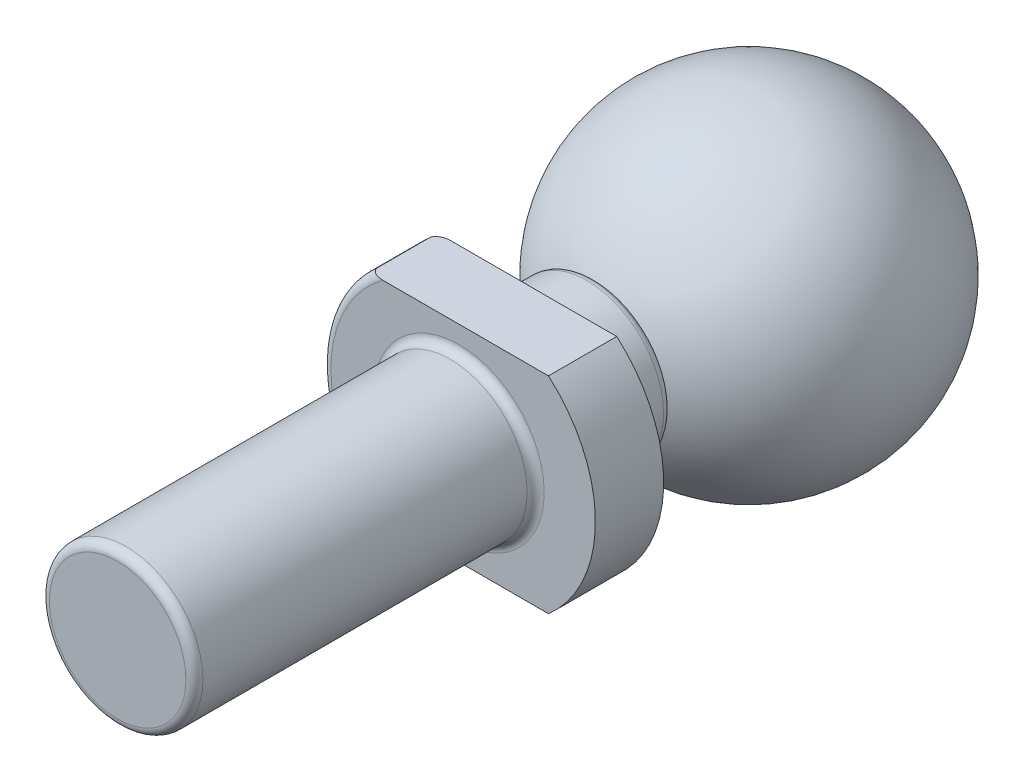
from build123d import *

# Parameters (mm, degrees)
ESQUISSE2_R             = 1.75
ENL_V_MAT_EXTRU_1_DEPTH = 14.148193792
ESQUISSE3_R             = 1.5
EXTRUSION1_DEPTH        = 1.5
ESQUISSE4_R             = 2.25
EXTRUSION2_DEPTH        = 2
ESQUISSE5_R             = 4
EXTRUSION3_DEPTH        = 2
ESQUISSE6_R             = 2.25
EXTRUSION4_DEPTH        = 10
ENL_V_MAT_EXTRU_2_REACH = 18.982
CONG_2_R                = 0.25


with BuildPart() as part:
    # Esquisse1 → R_volution1 (revolve)
    with BuildSketch(Plane.XY):
        with BuildLine():
            Line((0, 0), (0, 9.5))
            ThreePointArc((0, 9.5), (4.75, 4.75), (0, 0))
        make_face()
    revolve(axis=Axis((0, 0, 0), (0, 1, 0)))

    # Esquisse2 → Enl_v. mat.-Extru.1 (cut, through all)
    with BuildSketch(Plane.XY.offset(3)):
        with Locations(Location((0, 4.75, 0), (0, 0, 180))):
            Circle(ESQUISSE2_R)
    extrude(amount=ENL_V_MAT_EXTRU_1_DEPTH, mode=Mode.SUBTRACT)

    # Esquisse3 → Extrusion1 (add)
    with BuildSketch(Plane.XY.offset(3)):
        with Locations((0, 4.75)):
            Circle(ESQUISSE3_R)
    extrude(amount=EXTRUSION1_DEPTH)

    # Esquisse4 → Extrusion2 (add)
    with BuildSketch(Plane.XY.offset(4.5)):
        with Locations((0, 4.75)):
            Circle(ESQUISSE4_R)
    extrude(amount=EXTRUSION2_DEPTH)

    # Esquisse5 → Extrusion3 (add)
    with BuildSketch(Plane.XY.offset(6.5)):
        with Locations((0, 4.75)):
            Circle(ESQUISSE5_R)
    extrude(amount=EXTRUSION3_DEPTH)

    # Esquisse6 → Extrusion4 (add)
    with BuildSketch(Plane.XY.offset(8.5)):
        with Locations((0, 4.75)):
            Circle(ESQUISSE6_R)
    extrude(amount=EXTRUSION4_DEPTH)

    # Esquisse7 → Enl_v. mat.-Extru.2 (cut, up to next)
    with BuildSketch(Plane.XY.offset(8.5), mode=Mode.PRIVATE) as enl_v_mat_extru_2_sk1:
        with BuildLine():
            Line((-2.625, 7.768174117), (2.625, 7.768174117))
            ThreePointArc((2.625, 7.768174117), (0, 8.75), (-2.625, 7.768174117))
        make_face()
    enl_v_mat_extru_2_tool1 = extrude(enl_v_mat_extru_2_sk1.sketch, amount=-ENL_V_MAT_EXTRU_2_REACH, mode=Mode.PRIVATE) & part.part
    # Esquisse7 → Enl_v. mat.-Extru.2 (cut, up to next)
    with BuildSketch(Plane.XY.offset(8.5), mode=Mode.PRIVATE) as enl_v_mat_extru_2_sk2:
        with BuildLine():
            Line((2.625, 1.731825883), (-2.625, 1.731825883))
            ThreePointArc((-2.625, 1.731825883), (0, 0.75), (2.625, 1.731825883))
        make_face()
    enl_v_mat_extru_2_tool2 = extrude(enl_v_mat_extru_2_sk2.sketch, amount=-ENL_V_MAT_EXTRU_2_REACH, mode=Mode.PRIVATE) & part.part
    add(enl_v_mat_extru_2_tool1.solids().sort_by_distance((0, 8.165353, 8.5))[0], mode=Mode.SUBTRACT)
    add(enl_v_mat_extru_2_tool2.solids().sort_by_distance((0, 1.334647, 8.5))[0], mode=Mode.SUBTRACT)

    # Cong_2
    cong_2_edges = [part.edges().sort_by_distance(p)[0] for p in [
        (-2.25, 4.75, 4.5),
        (-2.25, 4.75, 6.5),
        (-2.25, 4.75, 8.5),
        (-2.25, 4.75, 18.5),
        (-4, 4.75, 8.5),
        (-4, 4.75, 6.5),
    ]]
    fillet(cong_2_edges, radius=CONG_2_R)


solid = part.part
